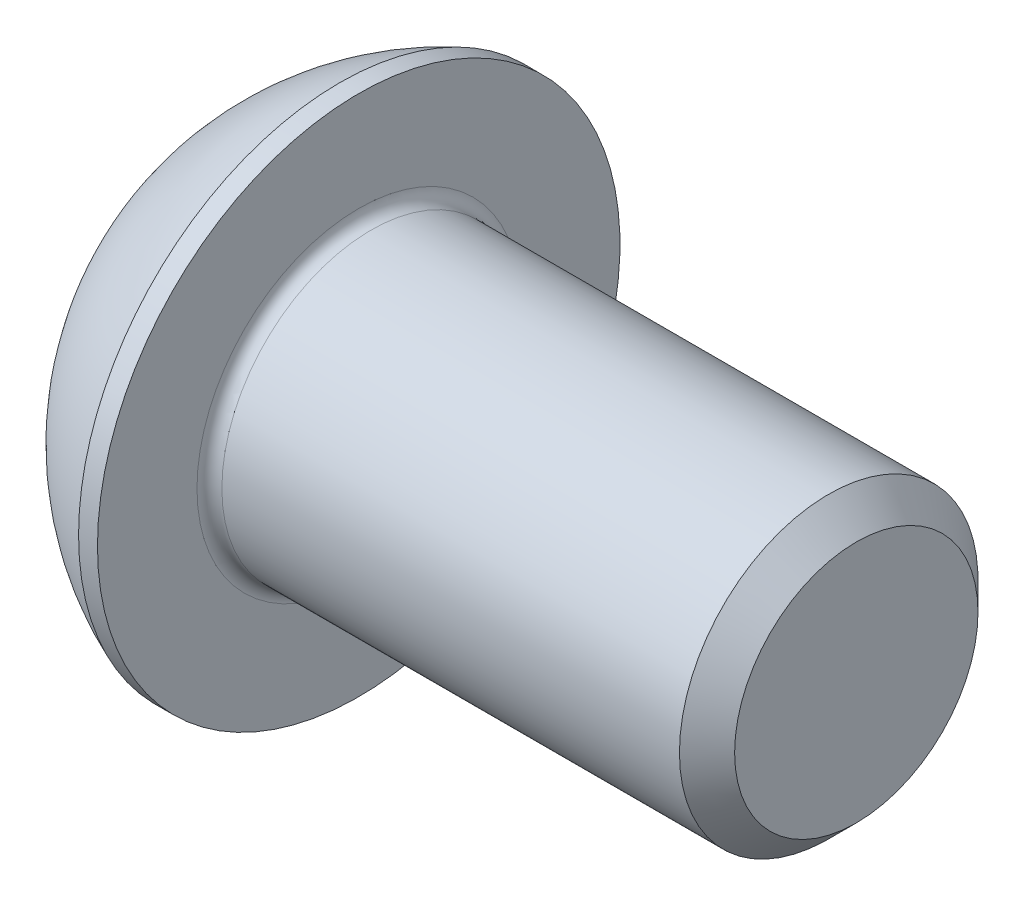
ISO-10303-21;
HEADER;
FILE_DESCRIPTION(('STEP AP214'),'2;1');
FILE_NAME('part.step','',(''),(''),'','','');
FILE_SCHEMA(('AUTOMOTIVE_DESIGN { 1 0 10303 214 1 1 1 1 }'));
ENDSEC;
DATA;
#1=APPLICATION_CONTEXT('core data for automotive mechanical design processes');
#2=APPLICATION_PROTOCOL_DEFINITION('international standard','automotive_design',2000,#1);
#3=PRODUCT_CONTEXT('',#1,'mechanical');
#4=PRODUCT('Part','Part','',(#3));
#5=PRODUCT_RELATED_PRODUCT_CATEGORY('part','',(#4));
#6=PRODUCT_DEFINITION_FORMATION('','',#4);
#7=PRODUCT_DEFINITION_CONTEXT('part definition',#1,'design');
#8=PRODUCT_DEFINITION('design','',#6,#7);
#9=PRODUCT_DEFINITION_SHAPE('','',#8);
#10=(LENGTH_UNIT() NAMED_UNIT(*) SI_UNIT(.MILLI.,.METRE.));
#11=(NAMED_UNIT(*) PLANE_ANGLE_UNIT() SI_UNIT($,.RADIAN.));
#12=(NAMED_UNIT(*) SI_UNIT($,.STERADIAN.) SOLID_ANGLE_UNIT());
#13=UNCERTAINTY_MEASURE_WITH_UNIT(LENGTH_MEASURE(1.E-05),#10,'distance_accuracy_value','');
#14=(GEOMETRIC_REPRESENTATION_CONTEXT(3) GLOBAL_UNCERTAINTY_ASSIGNED_CONTEXT((#13)) GLOBAL_UNIT_ASSIGNED_CONTEXT((#10,
#11,#12)) REPRESENTATION_CONTEXT('',''));
#15=CARTESIAN_POINT('',(0.,0.,0.));
#16=DIRECTION('',(0.,0.,1.));
#17=DIRECTION('',(1.,0.,0.));
#18=AXIS2_PLACEMENT_3D('',#15,#16,#17);
#19=CARTESIAN_POINT('',(0.,0.,0.));
#20=DIRECTION('',(-1.,0.,0.));
#21=DIRECTION('',(0.,0.,1.));
#22=AXIS2_PLACEMENT_3D('',#19,#20,#21);
#23=PLANE('',#22);
#24=CARTESIAN_POINT('',(0.,0.,0.));
#25=DIRECTION('',(-1.,0.,0.));
#26=DIRECTION('',(0.,0.,1.));
#27=AXIS2_PLACEMENT_3D('',#24,#25,#26);
#28=CIRCLE('',#27,2.625);
#29=CARTESIAN_POINT('',(0.,2.625,0.));
#30=VERTEX_POINT('',#29);
#31=EDGE_CURVE('E180',#30,#30,#28,.T.);
#32=ORIENTED_EDGE('',*,*,#31,.T.);
#33=EDGE_LOOP('',(#32));
#34=FACE_BOUND('',#33,.T.);
#35=DIRECTION('',(0.,-1.,0.));
#36=VECTOR('',#35,1.);
#37=CARTESIAN_POINT('',(0.,-1.15470053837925,2.));
#38=LINE('',#37,#36);
#39=CARTESIAN_POINT('',(0.,1.15470053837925,2.));
#40=VERTEX_POINT('',#39);
#41=CARTESIAN_POINT('',(0.,-1.15470053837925,2.));
#42=VERTEX_POINT('',#41);
#43=EDGE_CURVE('E60',#40,#42,#38,.T.);
#44=ORIENTED_EDGE('',*,*,#43,.T.);
#45=DIRECTION('',(0.,-0.5,-0.866025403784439));
#46=VECTOR('',#45,1.);
#47=CARTESIAN_POINT('',(0.,-2.3094010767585,0.));
#48=LINE('',#47,#46);
#49=CARTESIAN_POINT('',(0.,-2.3094010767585,0.));
#50=VERTEX_POINT('',#49);
#51=EDGE_CURVE('E278',#42,#50,#48,.T.);
#52=ORIENTED_EDGE('',*,*,#51,.T.);
#53=DIRECTION('',(0.,0.5,-0.866025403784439));
#54=VECTOR('',#53,1.);
#55=CARTESIAN_POINT('',(0.,-1.15470053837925,-2.));
#56=LINE('',#55,#54);
#57=CARTESIAN_POINT('',(0.,-1.15470053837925,-2.));
#58=VERTEX_POINT('',#57);
#59=EDGE_CURVE('E147',#50,#58,#56,.T.);
#60=ORIENTED_EDGE('',*,*,#59,.T.);
#61=DIRECTION('',(0.,1.,0.));
#62=VECTOR('',#61,1.);
#63=CARTESIAN_POINT('',(0.,1.15470053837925,-2.));
#64=LINE('',#63,#62);
#65=CARTESIAN_POINT('',(0.,1.15470053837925,-2.));
#66=VERTEX_POINT('',#65);
#67=EDGE_CURVE('E283',#58,#66,#64,.T.);
#68=ORIENTED_EDGE('',*,*,#67,.T.);
#69=DIRECTION('',(0.,0.5,0.866025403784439));
#70=VECTOR('',#69,1.);
#71=CARTESIAN_POINT('',(0.,2.3094010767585,0.));
#72=LINE('',#71,#70);
#73=CARTESIAN_POINT('',(0.,2.3094010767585,0.));
#74=VERTEX_POINT('',#73);
#75=EDGE_CURVE('E286',#66,#74,#72,.T.);
#76=ORIENTED_EDGE('',*,*,#75,.T.);
#77=DIRECTION('',(0.,-0.5,0.866025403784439));
#78=VECTOR('',#77,1.);
#79=CARTESIAN_POINT('',(0.,1.15470053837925,2.));
#80=LINE('',#79,#78);
#81=EDGE_CURVE('E289',#74,#40,#80,.T.);
#82=ORIENTED_EDGE('',*,*,#81,.T.);
#83=EDGE_LOOP('',(#44,#52,#60,#68,#76,#82));
#84=FACE_BOUND('',#83,.T.);
#85=ADVANCED_FACE('F44',(#34,#84),#23,.T.);
#86=CARTESIAN_POINT('',(4.99970462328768,0.,0.));
#87=DIRECTION('',(-1.,0.,0.));
#88=DIRECTION('',(0.,1.,0.));
#89=AXIS2_PLACEMENT_3D('',#86,#87,#88);
#90=SPHERICAL_SURFACE('',#89,5.64691697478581);
#91=CARTESIAN_POINT('',(2.92,0.,0.));
#92=DIRECTION('',(-1.,0.,0.));
#93=DIRECTION('',(0.,0.,1.));
#94=AXIS2_PLACEMENT_3D('',#91,#92,#93);
#95=CIRCLE('',#94,5.25);
#96=CARTESIAN_POINT('',(2.92,5.25,0.));
#97=VERTEX_POINT('',#96);
#98=EDGE_CURVE('E176',#97,#97,#95,.T.);
#99=CARTESIAN_POINT('',(2.92,5.25,0.));
#100=CARTESIAN_POINT('',(2.88116333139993,5.23461555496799,0.));
#101=CARTESIAN_POINT('',(2.84249743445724,5.21880002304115,0.));
#102=CARTESIAN_POINT('',(2.76552608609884,5.18631490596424,0.));
#103=CARTESIAN_POINT('',(2.72722063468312,5.16964532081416,0.));
#104=CARTESIAN_POINT('',(2.65098907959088,5.13546021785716,0.));
#105=CARTESIAN_POINT('',(2.61306297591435,5.11794470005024,0.));
#106=CARTESIAN_POINT('',(2.5376087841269,5.08207638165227,0.));
#107=CARTESIAN_POINT('',(2.50008069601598,5.06372358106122,0.));
#108=CARTESIAN_POINT('',(2.42544101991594,5.02618972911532,0.));
#109=CARTESIAN_POINT('',(2.38832943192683,5.00700867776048,0.));
#110=CARTESIAN_POINT('',(2.31454103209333,4.9678277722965,0.));
#111=CARTESIAN_POINT('',(2.27786422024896,4.94782791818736,0.));
#112=CARTESIAN_POINT('',(2.204963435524,4.90701925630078,0.));
#113=CARTESIAN_POINT('',(2.16873946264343,4.88621044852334,0.));
#114=CARTESIAN_POINT('',(2.09676219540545,4.84379412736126,0.));
#115=CARTESIAN_POINT('',(2.06100890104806,4.82218661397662,0.));
#116=CARTESIAN_POINT('',(1.9899905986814,4.77818352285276,0.));
#117=CARTESIAN_POINT('',(1.95472559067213,4.75578794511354,0.));
#118=CARTESIAN_POINT('',(1.88470122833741,4.7102197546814,0.));
#119=CARTESIAN_POINT('',(1.84994187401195,4.68704714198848,0.));
#120=CARTESIAN_POINT('',(1.78094593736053,4.63993629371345,0.));
#121=CARTESIAN_POINT('',(1.74670935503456,4.61599805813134,0.));
#122=CARTESIAN_POINT('',(1.67877582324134,4.56736775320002,0.));
#123=CARTESIAN_POINT('',(1.6450788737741,4.54267568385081,0.));
#124=CARTESIAN_POINT('',(1.57824120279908,4.4925498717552,0.));
#125=CARTESIAN_POINT('',(1.54510048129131,4.4671161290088,0.));
#126=CARTESIAN_POINT('',(1.4793915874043,4.4155194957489,0.));
#127=CARTESIAN_POINT('',(1.44682341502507,4.38935660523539,0.));
#128=CARTESIAN_POINT('',(1.3822756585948,4.33631456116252,0.));
#129=CARTESIAN_POINT('',(1.35029607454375,4.30943540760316,0.));
#130=CARTESIAN_POINT('',(1.28694124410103,4.2549740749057,0.));
#131=CARTESIAN_POINT('',(1.25556599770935,4.22739189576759,0.));
#132=CARTESIAN_POINT('',(1.19343529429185,4.17153809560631,0.));
#133=CARTESIAN_POINT('',(1.16267983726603,4.14326647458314,0.));
#134=CARTESIAN_POINT('',(1.10180385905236,4.0860477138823,0.));
#135=CARTESIAN_POINT('',(1.07168333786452,4.05710057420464,0.));
#136=CARTESIAN_POINT('',(1.01209206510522,3.99854503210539,0.));
#137=CARTESIAN_POINT('',(0.982621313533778,3.96893662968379,0.));
#138=CARTESIAN_POINT('',(0.924344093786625,3.90907314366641,0.));
#139=CARTESIAN_POINT('',(0.895537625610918,3.87881806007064,0.));
#140=CARTESIAN_POINT('',(0.838603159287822,3.8176761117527,0.));
#141=CARTESIAN_POINT('',(0.810475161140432,3.78678924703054,0.));
#142=CARTESIAN_POINT('',(0.754911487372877,3.72439894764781,0.));
#143=CARTESIAN_POINT('',(0.727475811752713,3.69289551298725,0.));
#144=CARTESIAN_POINT('',(0.673310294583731,3.62928758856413,0.));
#145=CARTESIAN_POINT('',(0.646580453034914,3.59718309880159,0.));
#146=CARTESIAN_POINT('',(0.593839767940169,3.53238887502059,0.));
#147=CARTESIAN_POINT('',(0.567828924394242,3.49969914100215,0.));
#148=CARTESIAN_POINT('',(0.516539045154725,3.43375052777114,0.));
#149=CARTESIAN_POINT('',(0.491260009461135,3.40049164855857,0.));
#150=CARTESIAN_POINT('',(0.441446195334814,3.33342112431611,0.));
#151=CARTESIAN_POINT('',(0.416911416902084,3.29960947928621,0.));
#152=CARTESIAN_POINT('',(0.368598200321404,3.23145007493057,0.));
#153=CARTESIAN_POINT('',(0.344819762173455,3.19710231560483,0.));
#154=CARTESIAN_POINT('',(0.298030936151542,3.12788759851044,0.));
#155=CARTESIAN_POINT('',(0.275020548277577,3.09302064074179,0.));
#156=CARTESIAN_POINT('',(0.229779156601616,3.02278469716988,0.));
#157=CARTESIAN_POINT('',(0.207548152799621,2.98741571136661,0.));
#158=CARTESIAN_POINT('',(0.163876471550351,2.91619313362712,0.));
#159=CARTESIAN_POINT('',(0.142435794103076,2.8803395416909,0.));
#160=CARTESIAN_POINT('',(0.100355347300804,2.80816539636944,0.));
#161=CARTESIAN_POINT('',(0.0797155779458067,2.7718448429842,0.));
#162=CARTESIAN_POINT('',(0.0392470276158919,2.69875470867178,0.));
#163=CARTESIAN_POINT('',(0.0194182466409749,2.66198512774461,0.));
#164=CARTESIAN_POINT('',(0.,2.625,0.));
#165=B_SPLINE_CURVE_WITH_KNOTS('',3,(#99,#100,#101,#102,#103,#104,#105,#106,#107,#108,#109,#110,
#111,#112,#113,#114,#115,#116,#117,#118,#119,#120,#121,#122,#123,#124,#125,#126,#127,#128,#129,
#130,#131,#132,#133,#134,#135,#136,#137,#138,#139,#140,#141,#142,#143,#144,#145,#146,#147,#148,
#149,#150,#151,#152,#153,#154,#155,#156,#157,#158,#159,#160,#161,#162,#163,#164),.UNSPECIFIED.,
.F.,.F.,(4,2,2,2,2,2,2,2,2,2,2,2,2,2,2,2,2,2,2,2,2,2,2,2,2,2,2,2,2,2,2,2,4),(0.,
0.12531586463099,0.25063172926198,0.375947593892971,0.50126345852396,0.62657932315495,
0.75189518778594,0.877211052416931,1.00252691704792,1.12784278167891,1.2531586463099,
1.37847451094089,1.50379037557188,1.62910624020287,1.75442210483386,1.87973796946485,
2.00505383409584,2.13036969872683,2.25568556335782,2.38100142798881,2.5063172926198,
2.63163315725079,2.75694902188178,2.88226488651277,3.00758075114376,3.13289661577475,
3.25821248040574,3.38352834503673,3.50884420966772,3.63416007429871,3.7594759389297,
3.88479180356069,4.01010766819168),.UNSPECIFIED.);
#166=EDGE_CURVE('BSEAM203',#97,#30,#165,.T.);
#167=ORIENTED_EDGE('',*,*,#98,.T.);
#168=ORIENTED_EDGE('',*,*,#31,.F.);
#169=ORIENTED_EDGE('',*,*,#166,.T.);
#170=ORIENTED_EDGE('',*,*,#166,.F.);
#171=EDGE_LOOP('',(#167,#169,#168,#170));
#172=FACE_BOUND('',#171,.T.);
#173=ADVANCED_FACE('F203',(#172),#90,.T.);
#174=CARTESIAN_POINT('',(0.,0.,0.));
#175=DIRECTION('',(-1.,0.,0.));
#176=DIRECTION('',(0.,0.,1.));
#177=AXIS2_PLACEMENT_3D('',#174,#175,#176);
#178=CYLINDRICAL_SURFACE('',#177,5.25);
#179=ORIENTED_EDGE('',*,*,#98,.F.);
#180=EDGE_LOOP('',(#179));
#181=FACE_BOUND('',#180,.T.);
#182=CARTESIAN_POINT('',(3.3,0.,0.));
#183=DIRECTION('',(-1.,0.,0.));
#184=DIRECTION('',(0.,0.,1.));
#185=AXIS2_PLACEMENT_3D('',#182,#183,#184);
#186=CIRCLE('',#185,5.25);
#187=CARTESIAN_POINT('',(3.3,0.,5.25));
#188=VERTEX_POINT('',#187);
#189=EDGE_CURVE('E172',#188,#188,#186,.T.);
#190=ORIENTED_EDGE('',*,*,#189,.T.);
#191=EDGE_LOOP('',(#190));
#192=FACE_BOUND('',#191,.T.);
#193=ADVANCED_FACE('F208',(#181,#192),#178,.T.);
#194=CARTESIAN_POINT('',(3.3,3.,0.));
#195=DIRECTION('',(-1.,0.,0.));
#196=DIRECTION('',(0.,0.,1.));
#197=AXIS2_PLACEMENT_3D('',#194,#195,#196);
#198=PLANE('',#197);
#199=CARTESIAN_POINT('',(3.3,0.,0.));
#200=DIRECTION('',(-1.,0.,0.));
#201=DIRECTION('',(0.,0.,1.));
#202=AXIS2_PLACEMENT_3D('',#199,#200,#201);
#203=CIRCLE('',#202,3.25);
#204=CARTESIAN_POINT('',(3.3,0.,3.25));
#205=VERTEX_POINT('',#204);
#206=EDGE_CURVE('E53',#205,#205,#203,.T.);
#207=ORIENTED_EDGE('',*,*,#206,.T.);
#208=EDGE_LOOP('',(#207));
#209=FACE_BOUND('',#208,.T.);
#210=ORIENTED_EDGE('',*,*,#189,.F.);
#211=EDGE_LOOP('',(#210));
#212=FACE_BOUND('',#211,.T.);
#213=ADVANCED_FACE('F187',(#209,#212),#198,.F.);
#214=CARTESIAN_POINT('',(0.,0.,0.));
#215=DIRECTION('',(-1.,0.,0.));
#216=DIRECTION('',(0.,0.,1.));
#217=AXIS2_PLACEMENT_3D('',#214,#215,#216);
#218=CYLINDRICAL_SURFACE('',#217,3.);
#219=CARTESIAN_POINT('',(3.55,0.,0.));
#220=DIRECTION('',(-1.,0.,0.));
#221=DIRECTION('',(0.,0.,1.));
#222=AXIS2_PLACEMENT_3D('',#219,#220,#221);
#223=CIRCLE('',#222,3.);
#224=CARTESIAN_POINT('',(3.55,0.,3.));
#225=VERTEX_POINT('',#224);
#226=EDGE_CURVE('E11',#225,#225,#223,.F.);
#227=ORIENTED_EDGE('',*,*,#226,.T.);
#228=EDGE_LOOP('',(#227));
#229=FACE_BOUND('',#228,.T.);
#230=CARTESIAN_POINT('',(12.7455,0.,0.));
#231=DIRECTION('',(-1.,0.,0.));
#232=DIRECTION('',(0.,0.,1.));
#233=AXIS2_PLACEMENT_3D('',#230,#231,#232);
#234=CIRCLE('',#233,3.);
#235=CARTESIAN_POINT('',(12.7455,0.,3.));
#236=VERTEX_POINT('',#235);
#237=EDGE_CURVE('E168',#236,#236,#234,.T.);
#238=ORIENTED_EDGE('',*,*,#237,.T.);
#239=EDGE_LOOP('',(#238));
#240=FACE_BOUND('',#239,.T.);
#241=ADVANCED_FACE('F217',(#229,#240),#218,.T.);
#242=CARTESIAN_POINT('',(13.3,0.,0.));
#243=DIRECTION('',(-1.,0.,0.));
#244=DIRECTION('',(0.,0.,1.));
#245=AXIS2_PLACEMENT_3D('',#242,#243,#244);
#246=CONICAL_SURFACE('',#245,2.4455,0.785398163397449);
#247=ORIENTED_EDGE('',*,*,#237,.F.);
#248=EDGE_LOOP('',(#247));
#249=FACE_BOUND('',#248,.T.);
#250=CARTESIAN_POINT('',(13.3,0.,0.));
#251=DIRECTION('',(-1.,0.,0.));
#252=DIRECTION('',(0.,0.,1.));
#253=AXIS2_PLACEMENT_3D('',#250,#251,#252);
#254=CIRCLE('',#253,2.4455);
#255=CARTESIAN_POINT('',(13.3,0.,2.4455));
#256=VERTEX_POINT('',#255);
#257=EDGE_CURVE('E163',#256,#256,#254,.T.);
#258=ORIENTED_EDGE('',*,*,#257,.T.);
#259=EDGE_LOOP('',(#258));
#260=FACE_BOUND('',#259,.T.);
#261=ADVANCED_FACE('F198',(#249,#260),#246,.T.);
#262=CARTESIAN_POINT('',(13.3,0.,0.));
#263=DIRECTION('',(-1.,0.,0.));
#264=DIRECTION('',(0.,0.,1.));
#265=AXIS2_PLACEMENT_3D('',#262,#263,#264);
#266=PLANE('',#265);
#267=ORIENTED_EDGE('',*,*,#257,.F.);
#268=EDGE_LOOP('',(#267));
#269=FACE_BOUND('',#268,.T.);
#270=ADVANCED_FACE('F191',(#269),#266,.F.);
#271=CARTESIAN_POINT('',(3.55,0.,0.));
#272=DIRECTION('',(-1.,0.,0.));
#273=DIRECTION('',(0.,0.,1.));
#274=AXIS2_PLACEMENT_3D('',#271,#272,#273);
#275=TOROIDAL_SURFACE('',#274,3.25,0.25);
#276=ORIENTED_EDGE('',*,*,#226,.F.);
#277=EDGE_LOOP('',(#276));
#278=FACE_BOUND('',#277,.T.);
#279=ORIENTED_EDGE('',*,*,#206,.F.);
#280=EDGE_LOOP('',(#279));
#281=FACE_BOUND('',#280,.T.);
#282=ADVANCED_FACE('F46',(#278,#281),#275,.F.);
#283=CARTESIAN_POINT('',(2.08,-2.3094010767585,0.));
#284=DIRECTION('',(0.,0.866025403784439,-0.5));
#285=DIRECTION('',(0.,0.5,0.866025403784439));
#286=AXIS2_PLACEMENT_3D('',#283,#284,#285);
#287=PLANE('',#286);
#288=DIRECTION('',(0.,-0.5,-0.866025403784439));
#289=VECTOR('',#288,1.);
#290=CARTESIAN_POINT('',(2.08,-2.3094010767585,0.));
#291=LINE('',#290,#289);
#292=CARTESIAN_POINT('',(2.08,-1.15470053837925,2.));
#293=VERTEX_POINT('',#292);
#294=CARTESIAN_POINT('',(2.08,-1.73205080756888,0.999999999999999));
#295=VERTEX_POINT('',#294);
#296=EDGE_CURVE('E128',#293,#295,#291,.T.);
#297=ORIENTED_EDGE('',*,*,#296,.T.);
#298=CARTESIAN_POINT('',(2.08,-2.3094010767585,0.));
#299=VERTEX_POINT('',#298);
#300=EDGE_CURVE('E121',#295,#299,#291,.T.);
#301=ORIENTED_EDGE('',*,*,#300,.T.);
#302=DIRECTION('',(-1.,0.,0.));
#303=VECTOR('',#302,1.);
#304=CARTESIAN_POINT('',(2.08,-2.3094010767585,0.));
#305=LINE('',#304,#303);
#306=EDGE_CURVE('E125',#299,#50,#305,.T.);
#307=ORIENTED_EDGE('',*,*,#306,.T.);
#308=ORIENTED_EDGE('',*,*,#51,.F.);
#309=DIRECTION('',(-1.,0.,0.));
#310=VECTOR('',#309,1.);
#311=CARTESIAN_POINT('',(2.08,-1.15470053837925,2.));
#312=LINE('',#311,#310);
#313=EDGE_CURVE('E266',#293,#42,#312,.T.);
#314=ORIENTED_EDGE('',*,*,#313,.F.);
#315=EDGE_LOOP('',(#297,#301,#307,#308,#314));
#316=FACE_BOUND('',#315,.T.);
#317=ADVANCED_FACE('F123',(#316),#287,.T.);
#318=CARTESIAN_POINT('',(2.08,-1.15470053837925,-2.));
#319=DIRECTION('',(0.,0.866025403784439,0.5));
#320=DIRECTION('',(0.,-0.5,0.866025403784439));
#321=AXIS2_PLACEMENT_3D('',#318,#319,#320);
#322=PLANE('',#321);
#323=DIRECTION('',(0.,0.5,-0.866025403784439));
#324=VECTOR('',#323,1.);
#325=CARTESIAN_POINT('',(2.08,-1.15470053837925,-2.));
#326=LINE('',#325,#324);
#327=CARTESIAN_POINT('',(2.08,-1.73205080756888,-0.999999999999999));
#328=VERTEX_POINT('',#327);
#329=EDGE_CURVE('E134',#299,#328,#326,.T.);
#330=ORIENTED_EDGE('',*,*,#329,.T.);
#331=CARTESIAN_POINT('',(2.08,-1.15470053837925,-2.));
#332=VERTEX_POINT('',#331);
#333=EDGE_CURVE('E142',#328,#332,#326,.T.);
#334=ORIENTED_EDGE('',*,*,#333,.T.);
#335=DIRECTION('',(-1.,0.,0.));
#336=VECTOR('',#335,1.);
#337=CARTESIAN_POINT('',(2.08,-1.15470053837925,-2.));
#338=LINE('',#337,#336);
#339=EDGE_CURVE('E150',#332,#58,#338,.T.);
#340=ORIENTED_EDGE('',*,*,#339,.T.);
#341=ORIENTED_EDGE('',*,*,#59,.F.);
#342=ORIENTED_EDGE('',*,*,#306,.F.);
#343=EDGE_LOOP('',(#330,#334,#340,#341,#342));
#344=FACE_BOUND('',#343,.T.);
#345=ADVANCED_FACE('F145',(#344),#322,.T.);
#346=CARTESIAN_POINT('',(2.08,1.15470053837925,-2.));
#347=DIRECTION('',(0.,0.,1.));
#348=DIRECTION('',(1.,0.,0.));
#349=AXIS2_PLACEMENT_3D('',#346,#347,#348);
#350=PLANE('',#349);
#351=DIRECTION('',(0.,1.,0.));
#352=VECTOR('',#351,1.);
#353=CARTESIAN_POINT('',(2.08,1.15470053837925,-2.));
#354=LINE('',#353,#352);
#355=CARTESIAN_POINT('',(2.08,0.,-2.));
#356=VERTEX_POINT('',#355);
#357=EDGE_CURVE('E313',#332,#356,#354,.T.);
#358=ORIENTED_EDGE('',*,*,#357,.T.);
#359=CARTESIAN_POINT('',(2.08,1.15470053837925,-2.));
#360=VERTEX_POINT('',#359);
#361=EDGE_CURVE('E141',#356,#360,#354,.T.);
#362=ORIENTED_EDGE('',*,*,#361,.T.);
#363=DIRECTION('',(-1.,0.,0.));
#364=VECTOR('',#363,1.);
#365=CARTESIAN_POINT('',(2.08,1.15470053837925,-2.));
#366=LINE('',#365,#364);
#367=EDGE_CURVE('E157',#360,#66,#366,.T.);
#368=ORIENTED_EDGE('',*,*,#367,.T.);
#369=ORIENTED_EDGE('',*,*,#67,.F.);
#370=ORIENTED_EDGE('',*,*,#339,.F.);
#371=EDGE_LOOP('',(#358,#362,#368,#369,#370));
#372=FACE_BOUND('',#371,.T.);
#373=ADVANCED_FACE('F231',(#372),#350,.T.);
#374=CARTESIAN_POINT('',(2.08,2.3094010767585,0.));
#375=DIRECTION('',(0.,-0.866025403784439,0.5));
#376=DIRECTION('',(0.,-0.5,-0.866025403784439));
#377=AXIS2_PLACEMENT_3D('',#374,#375,#376);
#378=PLANE('',#377);
#379=DIRECTION('',(0.,0.5,0.866025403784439));
#380=VECTOR('',#379,1.);
#381=CARTESIAN_POINT('',(2.08,2.3094010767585,0.));
#382=LINE('',#381,#380);
#383=CARTESIAN_POINT('',(2.08,1.73205080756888,-1.));
#384=VERTEX_POINT('',#383);
#385=EDGE_CURVE('E322',#360,#384,#382,.T.);
#386=ORIENTED_EDGE('',*,*,#385,.T.);
#387=CARTESIAN_POINT('',(2.08,2.3094010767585,0.));
#388=VERTEX_POINT('',#387);
#389=EDGE_CURVE('E318',#384,#388,#382,.T.);
#390=ORIENTED_EDGE('',*,*,#389,.T.);
#391=DIRECTION('',(-1.,0.,0.));
#392=VECTOR('',#391,1.);
#393=CARTESIAN_POINT('',(2.08,2.3094010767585,0.));
#394=LINE('',#393,#392);
#395=EDGE_CURVE('E297',#388,#74,#394,.T.);
#396=ORIENTED_EDGE('',*,*,#395,.T.);
#397=ORIENTED_EDGE('',*,*,#75,.F.);
#398=ORIENTED_EDGE('',*,*,#367,.F.);
#399=EDGE_LOOP('',(#386,#390,#396,#397,#398));
#400=FACE_BOUND('',#399,.T.);
#401=ADVANCED_FACE('F234',(#400),#378,.T.);
#402=CARTESIAN_POINT('',(2.08,1.15470053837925,2.));
#403=DIRECTION('',(0.,-0.866025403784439,-0.5));
#404=DIRECTION('',(0.,0.5,-0.866025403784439));
#405=AXIS2_PLACEMENT_3D('',#402,#403,#404);
#406=PLANE('',#405);
#407=DIRECTION('',(0.,-0.5,0.866025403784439));
#408=VECTOR('',#407,1.);
#409=CARTESIAN_POINT('',(2.08,1.15470053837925,2.));
#410=LINE('',#409,#408);
#411=CARTESIAN_POINT('',(2.08,1.73205080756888,1.));
#412=VERTEX_POINT('',#411);
#413=EDGE_CURVE('E274',#388,#412,#410,.T.);
#414=ORIENTED_EDGE('',*,*,#413,.T.);
#415=CARTESIAN_POINT('',(2.08,1.15470053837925,2.));
#416=VERTEX_POINT('',#415);
#417=EDGE_CURVE('E263',#412,#416,#410,.T.);
#418=ORIENTED_EDGE('',*,*,#417,.T.);
#419=DIRECTION('',(-1.,0.,0.));
#420=VECTOR('',#419,1.);
#421=CARTESIAN_POINT('',(2.08,1.15470053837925,2.));
#422=LINE('',#421,#420);
#423=EDGE_CURVE('E272',#416,#40,#422,.T.);
#424=ORIENTED_EDGE('',*,*,#423,.T.);
#425=ORIENTED_EDGE('',*,*,#81,.F.);
#426=ORIENTED_EDGE('',*,*,#395,.F.);
#427=EDGE_LOOP('',(#414,#418,#424,#425,#426));
#428=FACE_BOUND('',#427,.T.);
#429=ADVANCED_FACE('F238',(#428),#406,.T.);
#430=CARTESIAN_POINT('',(2.08,-1.15470053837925,2.));
#431=DIRECTION('',(0.,0.,-1.));
#432=DIRECTION('',(-1.,0.,0.));
#433=AXIS2_PLACEMENT_3D('',#430,#431,#432);
#434=PLANE('',#433);
#435=DIRECTION('',(0.,-1.,0.));
#436=VECTOR('',#435,1.);
#437=CARTESIAN_POINT('',(2.08,-1.15470053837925,2.));
#438=LINE('',#437,#436);
#439=CARTESIAN_POINT('',(2.08,0.,2.));
#440=VERTEX_POINT('',#439);
#441=EDGE_CURVE('E68',#416,#440,#438,.T.);
#442=ORIENTED_EDGE('',*,*,#441,.T.);
#443=EDGE_CURVE('E267',#440,#293,#438,.T.);
#444=ORIENTED_EDGE('',*,*,#443,.T.);
#445=ORIENTED_EDGE('',*,*,#313,.T.);
#446=ORIENTED_EDGE('',*,*,#43,.F.);
#447=ORIENTED_EDGE('',*,*,#423,.F.);
#448=EDGE_LOOP('',(#442,#444,#445,#446,#447));
#449=FACE_BOUND('',#448,.T.);
#450=ADVANCED_FACE('F242',(#449),#434,.T.);
#451=CARTESIAN_POINT('',(2.08,-1.15470053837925,2.));
#452=DIRECTION('',(-1.,0.,0.));
#453=DIRECTION('',(0.,0.,1.));
#454=AXIS2_PLACEMENT_3D('',#451,#452,#453);
#455=PLANE('',#454);
#456=ORIENTED_EDGE('',*,*,#441,.F.);
#457=ORIENTED_EDGE('',*,*,#417,.F.);
#458=CARTESIAN_POINT('',(2.08,0.,0.));
#459=DIRECTION('',(-1.,0.,0.));
#460=DIRECTION('',(0.,0.,1.));
#461=AXIS2_PLACEMENT_3D('',#458,#459,#460);
#462=CIRCLE('',#461,2.);
#463=EDGE_CURVE('E156',#440,#412,#462,.T.);
#464=ORIENTED_EDGE('',*,*,#463,.F.);
#465=EDGE_LOOP('',(#456,#457,#464));
#466=FACE_BOUND('',#465,.T.);
#467=ADVANCED_FACE('F246',(#466),#455,.T.);
#468=ORIENTED_EDGE('',*,*,#413,.F.);
#469=ORIENTED_EDGE('',*,*,#389,.F.);
#470=EDGE_CURVE('E164',#412,#384,#462,.T.);
#471=ORIENTED_EDGE('',*,*,#470,.F.);
#472=EDGE_LOOP('',(#468,#469,#471));
#473=FACE_BOUND('',#472,.T.);
#474=ADVANCED_FACE('F254',(#473),#455,.T.);
#475=ORIENTED_EDGE('',*,*,#385,.F.);
#476=ORIENTED_EDGE('',*,*,#361,.F.);
#477=EDGE_CURVE('E334',#384,#356,#462,.T.);
#478=ORIENTED_EDGE('',*,*,#477,.F.);
#479=EDGE_LOOP('',(#475,#476,#478));
#480=FACE_BOUND('',#479,.T.);
#481=ADVANCED_FACE('F259',(#480),#455,.T.);
#482=ORIENTED_EDGE('',*,*,#357,.F.);
#483=ORIENTED_EDGE('',*,*,#333,.F.);
#484=EDGE_CURVE('E316',#356,#328,#462,.T.);
#485=ORIENTED_EDGE('',*,*,#484,.F.);
#486=EDGE_LOOP('',(#482,#483,#485));
#487=FACE_BOUND('',#486,.T.);
#488=ADVANCED_FACE('F252',(#487),#455,.T.);
#489=ORIENTED_EDGE('',*,*,#329,.F.);
#490=ORIENTED_EDGE('',*,*,#300,.F.);
#491=EDGE_CURVE('E136',#328,#295,#462,.T.);
#492=ORIENTED_EDGE('',*,*,#491,.F.);
#493=EDGE_LOOP('',(#489,#490,#492));
#494=FACE_BOUND('',#493,.T.);
#495=ADVANCED_FACE('F135',(#494),#455,.T.);
#496=ORIENTED_EDGE('',*,*,#296,.F.);
#497=ORIENTED_EDGE('',*,*,#443,.F.);
#498=EDGE_CURVE('E149',#295,#440,#462,.T.);
#499=ORIENTED_EDGE('',*,*,#498,.F.);
#500=EDGE_LOOP('',(#496,#497,#499));
#501=FACE_BOUND('',#500,.T.);
#502=ADVANCED_FACE('F226',(#501),#455,.T.);
#503=CARTESIAN_POINT('',(3.23470053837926,0.,0.));
#504=DIRECTION('',(-1.,0.,0.));
#505=DIRECTION('',(0.,0.,1.));
#506=AXIS2_PLACEMENT_3D('',#503,#504,#505);
#507=CONICAL_SURFACE('',#506,0.,1.04719755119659);
#508=ORIENTED_EDGE('',*,*,#463,.T.);
#509=ORIENTED_EDGE('',*,*,#470,.T.);
#510=ORIENTED_EDGE('',*,*,#477,.T.);
#511=ORIENTED_EDGE('',*,*,#484,.T.);
#512=ORIENTED_EDGE('',*,*,#491,.T.);
#513=ORIENTED_EDGE('',*,*,#498,.T.);
#514=EDGE_LOOP('',(#508,#509,#510,#511,#512,#513));
#515=FACE_BOUND('',#514,.T.);
#516=CARTESIAN_POINT('',(3.23470053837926,0.,0.));
#517=VERTEX_POINT('',#516);
#518=VERTEX_LOOP('',#517);
#519=FACE_BOUND('',#518,.T.);
#520=ADVANCED_FACE('F224',(#515,#519),#507,.F.);
#521=CLOSED_SHELL('',(#85,#173,#193,#213,#241,#261,#270,#282,#317,#345,#373,#401,#429,#450,#467,
#474,#481,#488,#495,#502,#520));
#522=MANIFOLD_SOLID_BREP('B2',#521);
#523=ADVANCED_BREP_SHAPE_REPRESENTATION('',(#18,#522),#14);
#524=SHAPE_DEFINITION_REPRESENTATION(#9,#523);
ENDSEC;
END-ISO-10303-21;
